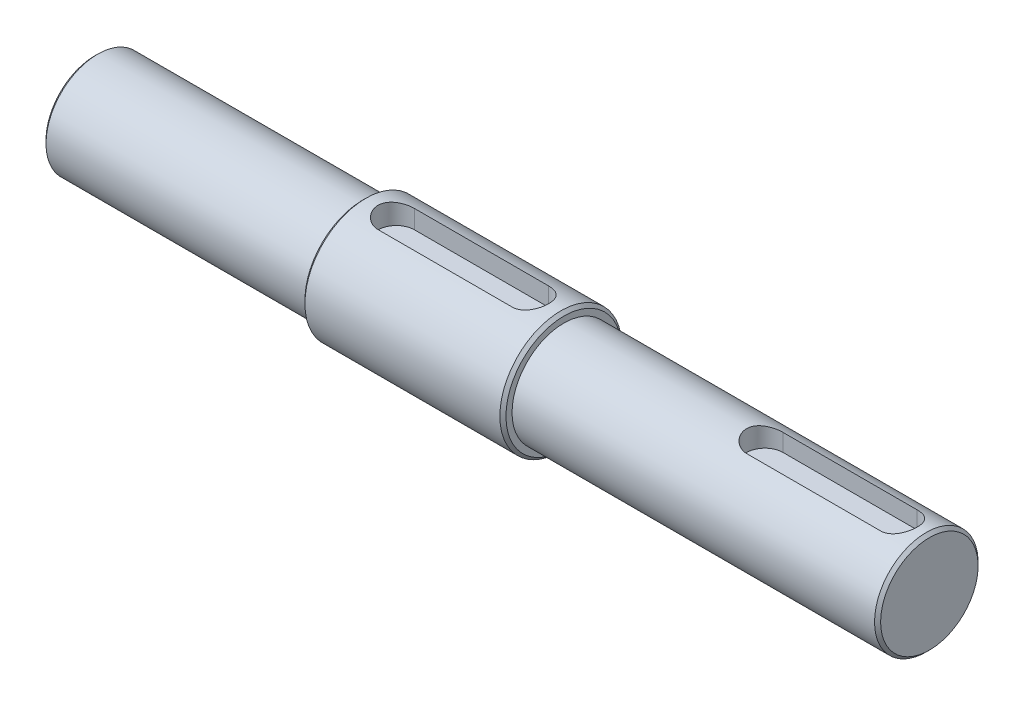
ISO-10303-21;
HEADER;
FILE_DESCRIPTION(('STEP AP214'),'2;1');
FILE_NAME('part.step','',(''),(''),'','','');
FILE_SCHEMA(('AUTOMOTIVE_DESIGN { 1 0 10303 214 1 1 1 1 }'));
ENDSEC;
DATA;
#1=APPLICATION_CONTEXT('core data for automotive mechanical design processes');
#2=APPLICATION_PROTOCOL_DEFINITION('international standard','automotive_design',2000,#1);
#3=PRODUCT_CONTEXT('',#1,'mechanical');
#4=PRODUCT('Part','Part','',(#3));
#5=PRODUCT_RELATED_PRODUCT_CATEGORY('part','',(#4));
#6=PRODUCT_DEFINITION_FORMATION('','',#4);
#7=PRODUCT_DEFINITION_CONTEXT('part definition',#1,'design');
#8=PRODUCT_DEFINITION('design','',#6,#7);
#9=PRODUCT_DEFINITION_SHAPE('','',#8);
#10=(LENGTH_UNIT() NAMED_UNIT(*) SI_UNIT(.MILLI.,.METRE.));
#11=(NAMED_UNIT(*) PLANE_ANGLE_UNIT() SI_UNIT($,.RADIAN.));
#12=(NAMED_UNIT(*) SI_UNIT($,.STERADIAN.) SOLID_ANGLE_UNIT());
#13=UNCERTAINTY_MEASURE_WITH_UNIT(LENGTH_MEASURE(1.E-05),#10,'distance_accuracy_value','');
#14=(GEOMETRIC_REPRESENTATION_CONTEXT(3) GLOBAL_UNCERTAINTY_ASSIGNED_CONTEXT((#13)) GLOBAL_UNIT_ASSIGNED_CONTEXT((#10,
#11,#12)) REPRESENTATION_CONTEXT('',''));
#15=CARTESIAN_POINT('',(0.,0.,0.));
#16=DIRECTION('',(0.,0.,1.));
#17=DIRECTION('',(1.,0.,0.));
#18=AXIS2_PLACEMENT_3D('',#15,#16,#17);
#19=CARTESIAN_POINT('',(0.,0.,0.));
#20=DIRECTION('',(-1.,0.,0.));
#21=DIRECTION('',(0.,0.,1.));
#22=AXIS2_PLACEMENT_3D('',#19,#20,#21);
#23=CYLINDRICAL_SURFACE('',#22,10.);
#24=CARTESIAN_POINT('',(44.5,0.,0.));
#25=DIRECTION('',(1.,0.,0.));
#26=DIRECTION('',(0.,0.,-1.));
#27=AXIS2_PLACEMENT_3D('',#24,#25,#26);
#28=CIRCLE('',#27,10.);
#29=CARTESIAN_POINT('',(44.5,0.,-10.));
#30=VERTEX_POINT('',#29);
#31=EDGE_CURVE('E57',#30,#30,#28,.T.);
#32=ORIENTED_EDGE('',*,*,#31,.T.);
#33=EDGE_LOOP('',(#32));
#34=FACE_BOUND('',#33,.T.);
#35=CARTESIAN_POINT('',(76.5,0.,0.));
#36=DIRECTION('',(-1.,0.,0.));
#37=DIRECTION('',(0.,0.,1.));
#38=AXIS2_PLACEMENT_3D('',#35,#36,#37);
#39=CIRCLE('',#38,10.);
#40=CARTESIAN_POINT('',(76.5,0.,10.));
#41=VERTEX_POINT('',#40);
#42=EDGE_CURVE('E286',#41,#41,#39,.T.);
#43=ORIENTED_EDGE('',*,*,#42,.T.);
#44=EDGE_LOOP('',(#43));
#45=FACE_BOUND('',#44,.T.);
#46=CARTESIAN_POINT('',(71.5,9.53939201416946,3.));
#47=CARTESIAN_POINT('',(71.5823355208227,9.53938054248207,3.00001027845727));
#48=CARTESIAN_POINT('',(71.6646644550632,9.54045772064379,2.99661062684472));
#49=CARTESIAN_POINT('',(71.8286939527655,9.54470412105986,2.98307142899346));
#50=CARTESIAN_POINT('',(71.9103946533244,9.54787287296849,2.97293339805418));
#51=CARTESIAN_POINT('',(72.0723849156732,9.55620668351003,2.94603140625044));
#52=CARTESIAN_POINT('',(72.152677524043,9.56136667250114,2.92928426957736));
#53=CARTESIAN_POINT('',(72.3114758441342,9.57351626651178,2.88932853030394));
#54=CARTESIAN_POINT('',(72.3899815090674,9.58050591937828,2.8661197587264));
#55=CARTESIAN_POINT('',(72.6219493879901,9.60391637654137,2.78708584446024));
#56=CARTESIAN_POINT('',(72.772068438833,9.62279007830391,2.72181852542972));
#57=CARTESIAN_POINT('',(73.059226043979,9.66493213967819,2.56815043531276));
#58=CARTESIAN_POINT('',(73.1962584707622,9.68820254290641,2.4797388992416));
#59=CARTESIAN_POINT('',(73.4577229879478,9.73733650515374,2.27929879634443));
#60=CARTESIAN_POINT('',(73.5816848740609,9.76325505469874,2.16666914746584));
#61=CARTESIAN_POINT('',(73.8092736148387,9.81429628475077,1.92227736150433));
#62=CARTESIAN_POINT('',(73.912897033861,9.8394188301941,1.79051199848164));
#63=CARTESIAN_POINT('',(74.0989268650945,9.88666477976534,1.50821997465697));
#64=CARTESIAN_POINT('',(74.1808501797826,9.90871541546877,1.35736167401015));
#65=CARTESIAN_POINT('',(74.3179770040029,9.94668940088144,1.04324233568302));
#66=CARTESIAN_POINT('',(74.373187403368,9.96261433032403,0.879984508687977));
#67=CARTESIAN_POINT('',(74.453759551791,9.98615279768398,0.550649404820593));
#68=CARTESIAN_POINT('',(74.4799297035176,9.99399098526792,0.384786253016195));
#69=CARTESIAN_POINT('',(74.504234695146,10.0012640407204,0.0508471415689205));
#70=CARTESIAN_POINT('',(74.5023748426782,10.0007004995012,-0.117228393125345));
#71=CARTESIAN_POINT('',(74.4712141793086,9.99139205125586,-0.445143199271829));
#72=CARTESIAN_POINT('',(74.4427893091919,9.98290831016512,-0.605074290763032));
#73=CARTESIAN_POINT('',(74.3607367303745,9.95903027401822,-0.917780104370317));
#74=CARTESIAN_POINT('',(74.3071077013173,9.94363561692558,-1.07055445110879));
#75=CARTESIAN_POINT('',(74.1755755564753,9.90730429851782,-1.36669563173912));
#76=CARTESIAN_POINT('',(74.0973967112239,9.88630511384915,-1.50993201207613));
#77=CARTESIAN_POINT('',(73.9192028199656,9.84099249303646,-1.78153105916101));
#78=CARTESIAN_POINT('',(73.8191828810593,9.81667831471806,-1.90989038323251));
#79=CARTESIAN_POINT('',(73.5956160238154,9.7662334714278,-2.15330901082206));
#80=CARTESIAN_POINT('',(73.4713122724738,9.74006890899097,-2.26766702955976));
#81=CARTESIAN_POINT('',(73.2050051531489,9.68968430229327,-2.47413538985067));
#82=CARTESIAN_POINT('',(73.0629966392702,9.66546482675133,-2.5662392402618));
#83=CARTESIAN_POINT('',(72.7634381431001,9.62154457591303,-2.72632814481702));
#84=CARTESIAN_POINT('',(72.6057456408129,9.60189192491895,-2.79406012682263));
#85=CARTESIAN_POINT('',(72.2805509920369,9.56991327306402,-2.90171772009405));
#86=CARTESIAN_POINT('',(72.1130642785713,9.55757606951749,-2.94168586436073));
#87=CARTESIAN_POINT('',(71.8700102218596,9.54628064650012,-2.97802407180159));
#88=CARTESIAN_POINT('',(71.7962185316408,9.54370312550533,-2.98626405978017));
#89=CARTESIAN_POINT('',(71.648297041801,9.54025857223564,-2.99724711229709));
#90=CARTESIAN_POINT('',(71.5741679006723,9.53938902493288,-2.99999825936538));
#91=CARTESIAN_POINT('',(71.5,9.53939201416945,-3.));
#92=B_SPLINE_CURVE_WITH_KNOTS('',3,(#46,#47,#48,#49,#50,#51,#52,#53,#54,#55,#56,#57,#58,#59,#60,
#61,#62,#63,#64,#65,#66,#67,#68,#69,#70,#71,#72,#73,#74,#75,#76,#77,#78,#79,#80,#81,#82,#83,#84,
#85,#86,#87,#88,#89,#90,#91),.UNSPECIFIED.,.F.,.F.,(4,2,2,2,2,2,2,2,2,2,2,2,2,2,2,2,2,2,2,2,2,2,
4),(0.,0.246918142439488,0.493780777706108,0.740019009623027,0.986263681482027,1.47813347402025,
1.97023245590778,2.47635119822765,2.98255536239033,3.4992281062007,4.01576751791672,
4.51753600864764,5.01920948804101,5.50490358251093,5.99062312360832,6.48200583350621,
6.9734987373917,7.48389234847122,7.99443465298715,8.51013494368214,9.02504345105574,
9.24774267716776,9.47011372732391),.UNSPECIFIED.);
#93=CARTESIAN_POINT('',(71.5,9.53939201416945,3.));
#94=VERTEX_POINT('',#93);
#95=CARTESIAN_POINT('',(71.5,9.53939201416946,-3.));
#96=VERTEX_POINT('',#95);
#97=EDGE_CURVE('E121',#94,#96,#92,.T.);
#98=ORIENTED_EDGE('',*,*,#97,.F.);
#99=DIRECTION('',(-1.,0.,0.));
#100=VECTOR('',#99,1.);
#101=CARTESIAN_POINT('',(0.,9.53939201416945,3.00000000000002));
#102=LINE('',#101,#100);
#103=CARTESIAN_POINT('',(49.5,9.53939201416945,3.00000000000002));
#104=VERTEX_POINT('',#103);
#105=EDGE_CURVE('E231',#104,#94,#102,.F.);
#106=ORIENTED_EDGE('',*,*,#105,.F.);
#107=CARTESIAN_POINT('',(49.5,9.53939201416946,-3.));
#108=CARTESIAN_POINT('',(49.4176644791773,9.53938054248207,-3.00001027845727));
#109=CARTESIAN_POINT('',(49.3353355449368,9.54045772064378,-2.99661062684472));
#110=CARTESIAN_POINT('',(49.1713060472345,9.54470412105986,-2.98307142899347));
#111=CARTESIAN_POINT('',(49.0896053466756,9.54787287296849,-2.97293339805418));
#112=CARTESIAN_POINT('',(48.9276150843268,9.55620668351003,-2.94603140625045));
#113=CARTESIAN_POINT('',(48.847322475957,9.56136667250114,-2.92928426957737));
#114=CARTESIAN_POINT('',(48.6885241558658,9.57351626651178,-2.88932853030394));
#115=CARTESIAN_POINT('',(48.6100184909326,9.58050591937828,-2.8661197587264));
#116=CARTESIAN_POINT('',(48.3780506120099,9.60391637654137,-2.78708584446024));
#117=CARTESIAN_POINT('',(48.227931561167,9.62279007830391,-2.72181852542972));
#118=CARTESIAN_POINT('',(47.940773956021,9.66493213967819,-2.56815043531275));
#119=CARTESIAN_POINT('',(47.8037415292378,9.68820254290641,-2.47973889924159));
#120=CARTESIAN_POINT('',(47.5422770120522,9.73733650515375,-2.27929879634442));
#121=CARTESIAN_POINT('',(47.4183151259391,9.76325505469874,-2.16666914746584));
#122=CARTESIAN_POINT('',(47.1907263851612,9.81429628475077,-1.92227736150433));
#123=CARTESIAN_POINT('',(47.087102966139,9.8394188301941,-1.79051199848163));
#124=CARTESIAN_POINT('',(46.9010731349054,9.88666477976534,-1.50821997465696));
#125=CARTESIAN_POINT('',(46.8191498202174,9.90871541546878,-1.35736167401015));
#126=CARTESIAN_POINT('',(46.6820229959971,9.94668940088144,-1.04324233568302));
#127=CARTESIAN_POINT('',(46.626812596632,9.96261433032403,-0.879984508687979));
#128=CARTESIAN_POINT('',(46.546240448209,9.98615279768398,-0.550649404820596));
#129=CARTESIAN_POINT('',(46.5200702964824,9.99399098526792,-0.384786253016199));
#130=CARTESIAN_POINT('',(46.495765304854,10.0012640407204,-0.0508471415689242));
#131=CARTESIAN_POINT('',(46.4976251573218,10.0007004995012,0.117228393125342));
#132=CARTESIAN_POINT('',(46.5287858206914,9.99139205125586,0.445143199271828));
#133=CARTESIAN_POINT('',(46.5572106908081,9.98290831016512,0.605074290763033));
#134=CARTESIAN_POINT('',(46.6392632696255,9.95903027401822,0.917780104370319));
#135=CARTESIAN_POINT('',(46.6928922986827,9.94363561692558,1.07055445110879));
#136=CARTESIAN_POINT('',(46.8244244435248,9.90730429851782,1.36669563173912));
#137=CARTESIAN_POINT('',(46.9026032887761,9.88630511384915,1.50993201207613));
#138=CARTESIAN_POINT('',(47.0807971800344,9.84099249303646,1.78153105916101));
#139=CARTESIAN_POINT('',(47.1808171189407,9.81667831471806,1.90989038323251));
#140=CARTESIAN_POINT('',(47.4043839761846,9.7662334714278,2.15330901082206));
#141=CARTESIAN_POINT('',(47.5286877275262,9.74006890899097,2.26766702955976));
#142=CARTESIAN_POINT('',(47.7949948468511,9.68968430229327,2.47413538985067));
#143=CARTESIAN_POINT('',(47.9370033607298,9.66546482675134,2.56623924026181));
#144=CARTESIAN_POINT('',(48.2365618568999,9.62154457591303,2.72632814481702));
#145=CARTESIAN_POINT('',(48.3942543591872,9.60189192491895,2.79406012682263));
#146=CARTESIAN_POINT('',(48.7194490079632,9.56991327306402,2.90171772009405));
#147=CARTESIAN_POINT('',(48.8869357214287,9.55757606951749,2.94168586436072));
#148=CARTESIAN_POINT('',(49.1299897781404,9.54628064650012,2.97802407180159));
#149=CARTESIAN_POINT('',(49.2037814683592,9.54370312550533,2.98626405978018));
#150=CARTESIAN_POINT('',(49.3517029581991,9.54025857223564,2.99724711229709));
#151=CARTESIAN_POINT('',(49.4258320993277,9.53938902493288,2.99999825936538));
#152=CARTESIAN_POINT('',(49.5,9.53939201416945,3.));
#153=B_SPLINE_CURVE_WITH_KNOTS('',3,(#107,#108,#109,#110,#111,#112,#113,#114,#115,#116,#117,
#118,#119,#120,#121,#122,#123,#124,#125,#126,#127,#128,#129,#130,#131,#132,#133,#134,#135,#136,
#137,#138,#139,#140,#141,#142,#143,#144,#145,#146,#147,#148,#149,#150,#151,#152),.UNSPECIFIED.,
.F.,.F.,(4,2,2,2,2,2,2,2,2,2,2,2,2,2,2,2,2,2,2,2,2,2,4),(0.,0.246918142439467,0.493780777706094,
0.74001900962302,0.986263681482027,1.47813347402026,1.97023245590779,2.47635119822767,
2.98255536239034,3.49922810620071,4.01576751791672,4.51753600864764,5.01920948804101,
5.50490358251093,5.99062312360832,6.48200583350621,6.9734987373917,7.48389234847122,
7.99443465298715,8.51013494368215,9.02504345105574,9.24774267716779,9.47011372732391),.UNSPECIFIED.);
#154=CARTESIAN_POINT('',(49.5,9.53939201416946,-3.));
#155=VERTEX_POINT('',#154);
#156=EDGE_CURVE('E234',#155,#104,#153,.T.);
#157=ORIENTED_EDGE('',*,*,#156,.F.);
#158=DIRECTION('',(-1.,0.,0.));
#159=VECTOR('',#158,1.);
#160=CARTESIAN_POINT('',(0.,9.53939201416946,-2.99999999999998));
#161=LINE('',#160,#159);
#162=EDGE_CURVE('E243',#96,#155,#161,.T.);
#163=ORIENTED_EDGE('',*,*,#162,.F.);
#164=EDGE_LOOP('',(#98,#106,#157,#163));
#165=FACE_BOUND('',#164,.T.);
#166=ADVANCED_FACE('F47',(#34,#45,#165),#23,.T.);
#167=CARTESIAN_POINT('',(0.,0.,0.));
#168=DIRECTION('',(-1.,0.,0.));
#169=DIRECTION('',(0.,0.,1.));
#170=AXIS2_PLACEMENT_3D('',#167,#168,#169);
#171=CYLINDRICAL_SURFACE('',#170,8.5);
#172=CARTESIAN_POINT('',(136.5,0.,0.));
#173=DIRECTION('',(-1.,0.,0.));
#174=DIRECTION('',(0.,0.,1.));
#175=AXIS2_PLACEMENT_3D('',#172,#173,#174);
#176=CIRCLE('',#175,8.5);
#177=CARTESIAN_POINT('',(136.5,0.,8.5));
#178=VERTEX_POINT('',#177);
#179=EDGE_CURVE('E266',#178,#178,#176,.T.);
#180=ORIENTED_EDGE('',*,*,#179,.T.);
#181=EDGE_LOOP('',(#180));
#182=FACE_BOUND('',#181,.T.);
#183=CARTESIAN_POINT('',(77.,0.,0.));
#184=DIRECTION('',(-1.,0.,0.));
#185=DIRECTION('',(0.,0.,1.));
#186=AXIS2_PLACEMENT_3D('',#183,#184,#185);
#187=CIRCLE('',#186,8.5);
#188=CARTESIAN_POINT('',(77.,0.,8.5));
#189=VERTEX_POINT('',#188);
#190=EDGE_CURVE('E181',#189,#189,#187,.T.);
#191=ORIENTED_EDGE('',*,*,#190,.F.);
#192=EDGE_LOOP('',(#191));
#193=FACE_BOUND('',#192,.T.);
#194=CARTESIAN_POINT('',(132.,7.95298686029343,3.));
#195=CARTESIAN_POINT('',(132.081536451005,7.95297282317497,3.0000111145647));
#196=CARTESIAN_POINT('',(132.16306513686,7.95424043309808,2.99667616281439));
#197=CARTESIAN_POINT('',(132.32548339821,7.95923435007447,2.98340078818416));
#198=CARTESIAN_POINT('',(132.406373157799,7.96295992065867,2.97346234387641));
#199=CARTESIAN_POINT('',(132.56668088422,7.97274948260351,2.94710907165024));
#200=CARTESIAN_POINT('',(132.646102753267,7.97880590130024,2.93071521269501));
#201=CARTESIAN_POINT('',(132.803163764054,7.99305602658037,2.89162336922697));
#202=CARTESIAN_POINT('',(132.88080282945,8.00124982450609,2.86892511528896));
#203=CARTESIAN_POINT('',(133.110142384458,8.02866628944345,2.79169040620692));
#204=CARTESIAN_POINT('',(133.258524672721,8.05074111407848,2.72797079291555));
#205=CARTESIAN_POINT('',(133.542527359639,8.09998309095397,2.57807364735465));
#206=CARTESIAN_POINT('',(133.678138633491,8.12715384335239,2.49188022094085));
#207=CARTESIAN_POINT('',(133.938713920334,8.18485393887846,2.29543806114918));
#208=CARTESIAN_POINT('',(134.063041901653,8.21547377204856,2.18437050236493));
#209=CARTESIAN_POINT('',(134.291744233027,8.2758622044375,1.94307879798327));
#210=CARTESIAN_POINT('',(134.396114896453,8.30563064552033,1.81285112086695));
#211=CARTESIAN_POINT('',(134.584937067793,8.36202878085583,1.53216678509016));
#212=CARTESIAN_POINT('',(134.668705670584,8.38853913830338,1.38122456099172));
#213=CARTESIAN_POINT('',(134.809399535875,8.43435112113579,1.06629732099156));
#214=CARTESIAN_POINT('',(134.866333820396,8.45365516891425,0.90231671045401));
#215=CARTESIAN_POINT('',(134.949541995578,8.48223599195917,0.572686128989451));
#216=CARTESIAN_POINT('',(134.976915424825,8.49187134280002,0.407345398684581));
#217=CARTESIAN_POINT('',(135.003733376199,8.50130846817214,0.0741521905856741));
#218=CARTESIAN_POINT('',(135.003185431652,8.50111289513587,-0.0936995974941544));
#219=CARTESIAN_POINT('',(134.974846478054,8.49114603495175,-0.419317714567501));
#220=CARTESIAN_POINT('',(134.948252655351,8.4817955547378,-0.577203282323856));
#221=CARTESIAN_POINT('',(134.870572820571,8.4551088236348,-0.88610464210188));
#222=CARTESIAN_POINT('',(134.819485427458,8.43777212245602,-1.03712004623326));
#223=CARTESIAN_POINT('',(134.693635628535,8.39655303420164,-1.33047393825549));
#224=CARTESIAN_POINT('',(134.618554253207,8.3725830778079,-1.47266277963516));
#225=CARTESIAN_POINT('',(134.447121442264,8.32056133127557,-1.742757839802));
#226=CARTESIAN_POINT('',(134.350763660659,8.29250832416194,-1.87065978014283));
#227=CARTESIAN_POINT('',(134.133598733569,8.23351601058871,-2.11563702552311));
#228=CARTESIAN_POINT('',(134.011776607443,8.20250248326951,-2.23179650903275));
#229=CARTESIAN_POINT('',(133.750160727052,8.1422878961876,-2.44236946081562));
#230=CARTESIAN_POINT('',(133.610360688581,8.11308747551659,-2.53677529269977));
#231=CARTESIAN_POINT('',(133.313330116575,8.05935715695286,-2.70269404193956));
#232=CARTESIAN_POINT('',(133.155828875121,8.03492183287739,-2.77375950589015));
#233=CARTESIAN_POINT('',(132.911749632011,8.0046686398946,-2.85940108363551));
#234=CARTESIAN_POINT('',(132.829101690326,7.9956519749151,-2.88445274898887));
#235=CARTESIAN_POINT('',(132.661749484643,7.98003696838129,-2.92737680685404));
#236=CARTESIAN_POINT('',(132.577046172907,7.97343752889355,-2.94525245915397));
#237=CARTESIAN_POINT('',(132.410501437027,7.96316283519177,-2.97292025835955));
#238=CARTESIAN_POINT('',(132.328726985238,7.95935855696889,-2.9830699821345));
#239=CARTESIAN_POINT('',(132.164637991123,7.95426482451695,-2.99661152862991));
#240=CARTESIAN_POINT('',(132.082324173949,7.95297249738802,-3.00001107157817));
#241=CARTESIAN_POINT('',(132.,7.95298686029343,-3.));
#242=B_SPLINE_CURVE_WITH_KNOTS('',3,(#194,#195,#196,#197,#198,#199,#200,#201,#202,#203,#204,
#205,#206,#207,#208,#209,#210,#211,#212,#213,#214,#215,#216,#217,#218,#219,#220,#221,#222,#223,
#224,#225,#226,#227,#228,#229,#230,#231,#232,#233,#234,#235,#236,#237,#238,#239,#240,#241),
.UNSPECIFIED.,.F.,.F.,(4,2,2,2,2,2,2,2,2,2,2,2,2,2,2,2,2,2,2,2,2,2,2,4),(0.,0.244518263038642,
0.488963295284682,0.732620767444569,0.976288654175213,1.46284365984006,1.9497437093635,
2.45596459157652,2.96227889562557,3.48361603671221,4.00477777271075,4.50580525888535,
5.00669756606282,5.4855977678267,5.9645249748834,6.45010405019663,6.93582815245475,
7.44695039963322,7.95825179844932,8.47884978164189,8.73905037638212,8.99913263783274,
9.24628958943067,9.49316370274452),.UNSPECIFIED.);
#243=CARTESIAN_POINT('',(132.,7.95298686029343,3.));
#244=VERTEX_POINT('',#243);
#245=CARTESIAN_POINT('',(132.,7.95298686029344,-3.));
#246=VERTEX_POINT('',#245);
#247=EDGE_CURVE('E224',#244,#246,#242,.T.);
#248=ORIENTED_EDGE('',*,*,#247,.F.);
#249=DIRECTION('',(-1.,0.,0.));
#250=VECTOR('',#249,1.);
#251=CARTESIAN_POINT('',(0.,7.95298686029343,3.00000000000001));
#252=LINE('',#251,#250);
#253=CARTESIAN_POINT('',(110.,7.95298686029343,3.00000000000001));
#254=VERTEX_POINT('',#253);
#255=EDGE_CURVE('E189',#254,#244,#252,.F.);
#256=ORIENTED_EDGE('',*,*,#255,.F.);
#257=CARTESIAN_POINT('',(110.,7.95298686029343,-3.));
#258=CARTESIAN_POINT('',(109.918463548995,7.95297282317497,-3.00001111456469));
#259=CARTESIAN_POINT('',(109.83693486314,7.95424043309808,-2.99667616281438));
#260=CARTESIAN_POINT('',(109.67451660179,7.95923435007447,-2.98340078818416));
#261=CARTESIAN_POINT('',(109.593626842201,7.96295992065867,-2.97346234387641));
#262=CARTESIAN_POINT('',(109.43331911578,7.97274948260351,-2.94710907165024));
#263=CARTESIAN_POINT('',(109.353897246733,7.97880590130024,-2.93071521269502));
#264=CARTESIAN_POINT('',(109.196836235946,7.99305602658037,-2.89162336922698));
#265=CARTESIAN_POINT('',(109.119197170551,8.00124982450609,-2.86892511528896));
#266=CARTESIAN_POINT('',(108.889857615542,8.02866628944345,-2.79169040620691));
#267=CARTESIAN_POINT('',(108.741475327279,8.05074111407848,-2.72797079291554));
#268=CARTESIAN_POINT('',(108.457472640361,8.09998309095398,-2.57807364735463));
#269=CARTESIAN_POINT('',(108.321861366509,8.12715384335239,-2.49188022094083));
#270=CARTESIAN_POINT('',(108.061286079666,8.18485393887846,-2.29543806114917));
#271=CARTESIAN_POINT('',(107.936958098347,8.21547377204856,-2.18437050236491));
#272=CARTESIAN_POINT('',(107.708255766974,8.2758622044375,-1.94307879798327));
#273=CARTESIAN_POINT('',(107.603885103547,8.30563064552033,-1.81285112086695));
#274=CARTESIAN_POINT('',(107.415062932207,8.36202878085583,-1.53216678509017));
#275=CARTESIAN_POINT('',(107.331294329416,8.38853913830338,-1.38122456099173));
#276=CARTESIAN_POINT('',(107.190600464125,8.43435112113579,-1.06629732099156));
#277=CARTESIAN_POINT('',(107.133666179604,8.45365516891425,-0.902316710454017));
#278=CARTESIAN_POINT('',(107.050458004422,8.48223599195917,-0.572686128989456));
#279=CARTESIAN_POINT('',(107.023084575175,8.49187134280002,-0.407345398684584));
#280=CARTESIAN_POINT('',(106.996266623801,8.50130846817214,-0.0741521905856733));
#281=CARTESIAN_POINT('',(106.996814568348,8.50111289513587,0.0936995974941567));
#282=CARTESIAN_POINT('',(107.025153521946,8.49114603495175,0.419317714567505));
#283=CARTESIAN_POINT('',(107.051747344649,8.4817955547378,0.577203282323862));
#284=CARTESIAN_POINT('',(107.129427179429,8.4551088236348,0.886104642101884));
#285=CARTESIAN_POINT('',(107.180514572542,8.43777212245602,1.03712004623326));
#286=CARTESIAN_POINT('',(107.306364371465,8.39655303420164,1.33047393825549));
#287=CARTESIAN_POINT('',(107.381445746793,8.3725830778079,1.47266277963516));
#288=CARTESIAN_POINT('',(107.552878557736,8.32056133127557,1.742757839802));
#289=CARTESIAN_POINT('',(107.649236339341,8.29250832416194,1.87065978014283));
#290=CARTESIAN_POINT('',(107.866401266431,8.23351601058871,2.11563702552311));
#291=CARTESIAN_POINT('',(107.988223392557,8.20250248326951,2.23179650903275));
#292=CARTESIAN_POINT('',(108.249839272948,8.1422878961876,2.44236946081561));
#293=CARTESIAN_POINT('',(108.389639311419,8.11308747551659,2.53677529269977));
#294=CARTESIAN_POINT('',(108.686669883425,8.05935715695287,2.70269404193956));
#295=CARTESIAN_POINT('',(108.844171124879,8.03492183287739,2.77375950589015));
#296=CARTESIAN_POINT('',(109.088250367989,8.0046686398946,2.85940108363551));
#297=CARTESIAN_POINT('',(109.170898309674,7.9956519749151,2.88445274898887));
#298=CARTESIAN_POINT('',(109.338250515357,7.98003696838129,2.92737680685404));
#299=CARTESIAN_POINT('',(109.422953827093,7.97343752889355,2.94525245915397));
#300=CARTESIAN_POINT('',(109.589498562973,7.96316283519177,2.97292025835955));
#301=CARTESIAN_POINT('',(109.671273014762,7.95935855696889,2.9830699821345));
#302=CARTESIAN_POINT('',(109.835362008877,7.95426482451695,2.99661152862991));
#303=CARTESIAN_POINT('',(109.917675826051,7.95297249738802,3.00001107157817));
#304=CARTESIAN_POINT('',(110.,7.95298686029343,3.));
#305=B_SPLINE_CURVE_WITH_KNOTS('',3,(#257,#258,#259,#260,#261,#262,#263,#264,#265,#266,#267,
#268,#269,#270,#271,#272,#273,#274,#275,#276,#277,#278,#279,#280,#281,#282,#283,#284,#285,#286,
#287,#288,#289,#290,#291,#292,#293,#294,#295,#296,#297,#298,#299,#300,#301,#302,#303,#304),
.UNSPECIFIED.,.F.,.F.,(4,2,2,2,2,2,2,2,2,2,2,2,2,2,2,2,2,2,2,2,2,2,2,4),(0.,0.244518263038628,
0.488963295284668,0.732620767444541,0.976288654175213,1.4628436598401,1.94974370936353,
2.45596459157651,2.96227889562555,3.4836160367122,4.00477777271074,4.50580525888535,
5.00669756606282,5.4855977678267,5.9645249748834,6.45010405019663,6.93582815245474,
7.44695039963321,7.95825179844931,8.47884978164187,8.73905037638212,8.99913263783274,
9.24628958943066,9.49316370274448),.UNSPECIFIED.);
#306=CARTESIAN_POINT('',(110.,7.95298686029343,-3.));
#307=VERTEX_POINT('',#306);
#308=EDGE_CURVE('E192',#307,#254,#305,.T.);
#309=ORIENTED_EDGE('',*,*,#308,.F.);
#310=DIRECTION('',(-1.,0.,0.));
#311=VECTOR('',#310,1.);
#312=CARTESIAN_POINT('',(0.,7.95298686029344,-2.99999999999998));
#313=LINE('',#312,#311);
#314=EDGE_CURVE('E201',#246,#307,#313,.T.);
#315=ORIENTED_EDGE('',*,*,#314,.F.);
#316=EDGE_LOOP('',(#248,#256,#309,#315));
#317=FACE_BOUND('',#316,.T.);
#318=ADVANCED_FACE('F203',(#182,#193,#317),#171,.T.);
#319=CARTESIAN_POINT('',(0.,0.,0.));
#320=DIRECTION('',(1.,0.,0.));
#321=DIRECTION('',(0.,0.,-1.));
#322=AXIS2_PLACEMENT_3D('',#319,#320,#321);
#323=PLANE('',#322);
#324=CARTESIAN_POINT('',(0.,0.,0.));
#325=DIRECTION('',(1.,0.,0.));
#326=DIRECTION('',(0.,0.,-1.));
#327=AXIS2_PLACEMENT_3D('',#324,#325,#326);
#328=CIRCLE('',#327,8.00000000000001);
#329=CARTESIAN_POINT('',(0.,0.,-8.00000000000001));
#330=VERTEX_POINT('',#329);
#331=EDGE_CURVE('E274',#330,#330,#328,.F.);
#332=ORIENTED_EDGE('',*,*,#331,.T.);
#333=EDGE_LOOP('',(#332));
#334=FACE_BOUND('',#333,.T.);
#335=ADVANCED_FACE('F309',(#334),#323,.F.);
#336=CARTESIAN_POINT('',(0.,0.,0.));
#337=DIRECTION('',(-1.,0.,0.));
#338=DIRECTION('',(0.,0.,1.));
#339=AXIS2_PLACEMENT_3D('',#336,#337,#338);
#340=CYLINDRICAL_SURFACE('',#339,8.5);
#341=CARTESIAN_POINT('',(0.500000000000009,0.,0.));
#342=DIRECTION('',(1.,0.,0.));
#343=DIRECTION('',(0.,0.,-1.));
#344=AXIS2_PLACEMENT_3D('',#341,#342,#343);
#345=CIRCLE('',#344,8.5);
#346=CARTESIAN_POINT('',(0.500000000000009,0.,-8.5));
#347=VERTEX_POINT('',#346);
#348=EDGE_CURVE('E278',#347,#347,#345,.T.);
#349=ORIENTED_EDGE('',*,*,#348,.T.);
#350=EDGE_LOOP('',(#349));
#351=FACE_BOUND('',#350,.T.);
#352=CARTESIAN_POINT('',(44.,0.,0.));
#353=DIRECTION('',(-1.,0.,0.));
#354=DIRECTION('',(0.,0.,1.));
#355=AXIS2_PLACEMENT_3D('',#352,#353,#354);
#356=CIRCLE('',#355,8.5);
#357=CARTESIAN_POINT('',(44.,0.,8.5));
#358=VERTEX_POINT('',#357);
#359=EDGE_CURVE('E185',#358,#358,#356,.T.);
#360=ORIENTED_EDGE('',*,*,#359,.T.);
#361=EDGE_LOOP('',(#360));
#362=FACE_BOUND('',#361,.T.);
#363=ADVANCED_FACE('F305',(#351,#362),#340,.T.);
#364=CARTESIAN_POINT('',(44.,8.5,0.));
#365=DIRECTION('',(1.,0.,0.));
#366=DIRECTION('',(0.,0.,-1.));
#367=AXIS2_PLACEMENT_3D('',#364,#365,#366);
#368=PLANE('',#367);
#369=CARTESIAN_POINT('',(44.,0.,0.));
#370=DIRECTION('',(1.,0.,0.));
#371=DIRECTION('',(0.,0.,-1.));
#372=AXIS2_PLACEMENT_3D('',#369,#370,#371);
#373=CIRCLE('',#372,9.49999999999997);
#374=CARTESIAN_POINT('',(44.,0.,-9.49999999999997));
#375=VERTEX_POINT('',#374);
#376=EDGE_CURVE('E282',#375,#375,#373,.F.);
#377=ORIENTED_EDGE('',*,*,#376,.T.);
#378=EDGE_LOOP('',(#377));
#379=FACE_BOUND('',#378,.T.);
#380=ORIENTED_EDGE('',*,*,#359,.F.);
#381=EDGE_LOOP('',(#380));
#382=FACE_BOUND('',#381,.T.);
#383=ADVANCED_FACE('F301',(#379,#382),#368,.F.);
#384=CARTESIAN_POINT('',(77.,10.,0.));
#385=DIRECTION('',(-1.,0.,0.));
#386=DIRECTION('',(0.,0.,1.));
#387=AXIS2_PLACEMENT_3D('',#384,#385,#386);
#388=PLANE('',#387);
#389=CARTESIAN_POINT('',(77.,0.,0.));
#390=DIRECTION('',(-1.,0.,0.));
#391=DIRECTION('',(0.,0.,1.));
#392=AXIS2_PLACEMENT_3D('',#389,#390,#391);
#393=CIRCLE('',#392,9.49999999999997);
#394=CARTESIAN_POINT('',(77.,0.,9.49999999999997));
#395=VERTEX_POINT('',#394);
#396=EDGE_CURVE('E11',#395,#395,#393,.F.);
#397=ORIENTED_EDGE('',*,*,#396,.T.);
#398=EDGE_LOOP('',(#397));
#399=FACE_BOUND('',#398,.T.);
#400=ORIENTED_EDGE('',*,*,#190,.T.);
#401=EDGE_LOOP('',(#400));
#402=FACE_BOUND('',#401,.T.);
#403=ADVANCED_FACE('F304',(#399,#402),#388,.F.);
#404=CARTESIAN_POINT('',(137.,8.5,0.));
#405=DIRECTION('',(-1.,0.,0.));
#406=DIRECTION('',(0.,0.,1.));
#407=AXIS2_PLACEMENT_3D('',#404,#405,#406);
#408=PLANE('',#407);
#409=CARTESIAN_POINT('',(137.,0.,0.));
#410=DIRECTION('',(-1.,0.,0.));
#411=DIRECTION('',(0.,0.,1.));
#412=AXIS2_PLACEMENT_3D('',#409,#410,#411);
#413=CIRCLE('',#412,8.00000000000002);
#414=CARTESIAN_POINT('',(137.,0.,8.00000000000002));
#415=VERTEX_POINT('',#414);
#416=EDGE_CURVE('E270',#415,#415,#413,.F.);
#417=ORIENTED_EDGE('',*,*,#416,.T.);
#418=EDGE_LOOP('',(#417));
#419=FACE_BOUND('',#418,.T.);
#420=ADVANCED_FACE('F222',(#419),#408,.F.);
#421=CARTESIAN_POINT('',(132.,15.1,0.));
#422=DIRECTION('',(0.,-1.,0.));
#423=DIRECTION('',(0.,0.,-1.));
#424=AXIS2_PLACEMENT_3D('',#421,#422,#423);
#425=CYLINDRICAL_SURFACE('',#424,3.);
#426=ORIENTED_EDGE('',*,*,#247,.T.);
#427=DIRECTION('',(0.,-1.,0.));
#428=VECTOR('',#427,1.);
#429=CARTESIAN_POINT('',(132.,15.1,-3.));
#430=LINE('',#429,#428);
#431=CARTESIAN_POINT('',(132.,5.1,-3.));
#432=VERTEX_POINT('',#431);
#433=EDGE_CURVE('E178',#246,#432,#430,.T.);
#434=ORIENTED_EDGE('',*,*,#433,.T.);
#435=CARTESIAN_POINT('',(132.,5.1,0.));
#436=DIRECTION('',(0.,1.,0.));
#437=DIRECTION('',(0.,0.,1.));
#438=AXIS2_PLACEMENT_3D('',#435,#436,#437);
#439=CIRCLE('',#438,3.);
#440=CARTESIAN_POINT('',(132.,5.1,3.));
#441=VERTEX_POINT('',#440);
#442=EDGE_CURVE('E125',#441,#432,#439,.T.);
#443=ORIENTED_EDGE('',*,*,#442,.F.);
#444=DIRECTION('',(0.,-1.,0.));
#445=VECTOR('',#444,1.);
#446=CARTESIAN_POINT('',(132.,15.1,3.));
#447=LINE('',#446,#445);
#448=EDGE_CURVE('E170',#244,#441,#447,.T.);
#449=ORIENTED_EDGE('',*,*,#448,.F.);
#450=EDGE_LOOP('',(#426,#434,#443,#449));
#451=FACE_BOUND('',#450,.T.);
#452=ADVANCED_FACE('F218',(#451),#425,.F.);
#453=CARTESIAN_POINT('',(132.,15.1,-3.));
#454=DIRECTION('',(0.,0.,1.));
#455=DIRECTION('',(1.,0.,0.));
#456=AXIS2_PLACEMENT_3D('',#453,#454,#455);
#457=PLANE('',#456);
#458=ORIENTED_EDGE('',*,*,#314,.T.);
#459=DIRECTION('',(0.,-1.,0.));
#460=VECTOR('',#459,1.);
#461=CARTESIAN_POINT('',(110.,15.1,-3.));
#462=LINE('',#461,#460);
#463=CARTESIAN_POINT('',(110.,5.1,-3.));
#464=VERTEX_POINT('',#463);
#465=EDGE_CURVE('E175',#307,#464,#462,.T.);
#466=ORIENTED_EDGE('',*,*,#465,.T.);
#467=DIRECTION('',(-1.,0.,0.));
#468=VECTOR('',#467,1.);
#469=CARTESIAN_POINT('',(132.,5.1,-3.));
#470=LINE('',#469,#468);
#471=EDGE_CURVE('E158',#432,#464,#470,.T.);
#472=ORIENTED_EDGE('',*,*,#471,.F.);
#473=ORIENTED_EDGE('',*,*,#433,.F.);
#474=EDGE_LOOP('',(#458,#466,#472,#473));
#475=FACE_BOUND('',#474,.T.);
#476=ADVANCED_FACE('F213',(#475),#457,.T.);
#477=CARTESIAN_POINT('',(110.,15.1,0.));
#478=DIRECTION('',(0.,-1.,0.));
#479=DIRECTION('',(0.,0.,-1.));
#480=AXIS2_PLACEMENT_3D('',#477,#478,#479);
#481=CYLINDRICAL_SURFACE('',#480,3.);
#482=ORIENTED_EDGE('',*,*,#308,.T.);
#483=DIRECTION('',(0.,-1.,0.));
#484=VECTOR('',#483,1.);
#485=CARTESIAN_POINT('',(110.,15.1,3.));
#486=LINE('',#485,#484);
#487=CARTESIAN_POINT('',(110.,5.1,3.));
#488=VERTEX_POINT('',#487);
#489=EDGE_CURVE('E72',#254,#488,#486,.T.);
#490=ORIENTED_EDGE('',*,*,#489,.T.);
#491=CARTESIAN_POINT('',(110.,5.1,0.));
#492=DIRECTION('',(0.,1.,0.));
#493=DIRECTION('',(0.,0.,1.));
#494=AXIS2_PLACEMENT_3D('',#491,#492,#493);
#495=CIRCLE('',#494,3.);
#496=EDGE_CURVE('E162',#464,#488,#495,.T.);
#497=ORIENTED_EDGE('',*,*,#496,.F.);
#498=ORIENTED_EDGE('',*,*,#465,.F.);
#499=EDGE_LOOP('',(#482,#490,#497,#498));
#500=FACE_BOUND('',#499,.T.);
#501=ADVANCED_FACE('F207',(#500),#481,.F.);
#502=CARTESIAN_POINT('',(132.,15.1,3.));
#503=DIRECTION('',(0.,0.,-1.));
#504=DIRECTION('',(-1.,0.,0.));
#505=AXIS2_PLACEMENT_3D('',#502,#503,#504);
#506=PLANE('',#505);
#507=ORIENTED_EDGE('',*,*,#255,.T.);
#508=ORIENTED_EDGE('',*,*,#448,.T.);
#509=DIRECTION('',(1.,0.,0.));
#510=VECTOR('',#509,1.);
#511=CARTESIAN_POINT('',(132.,5.1,3.));
#512=LINE('',#511,#510);
#513=EDGE_CURVE('E166',#488,#441,#512,.T.);
#514=ORIENTED_EDGE('',*,*,#513,.F.);
#515=ORIENTED_EDGE('',*,*,#489,.F.);
#516=EDGE_LOOP('',(#507,#508,#514,#515));
#517=FACE_BOUND('',#516,.T.);
#518=ADVANCED_FACE('F212',(#517),#506,.T.);
#519=CARTESIAN_POINT('',(132.,5.1,0.));
#520=DIRECTION('',(0.,1.,0.));
#521=DIRECTION('',(0.,0.,1.));
#522=AXIS2_PLACEMENT_3D('',#519,#520,#521);
#523=PLANE('',#522);
#524=ORIENTED_EDGE('',*,*,#442,.T.);
#525=ORIENTED_EDGE('',*,*,#471,.T.);
#526=ORIENTED_EDGE('',*,*,#496,.T.);
#527=ORIENTED_EDGE('',*,*,#513,.T.);
#528=EDGE_LOOP('',(#524,#525,#526,#527));
#529=FACE_BOUND('',#528,.T.);
#530=ADVANCED_FACE('F259',(#529),#523,.T.);
#531=CARTESIAN_POINT('',(71.5,16.5,0.));
#532=DIRECTION('',(0.,-1.,0.));
#533=DIRECTION('',(0.,0.,-1.));
#534=AXIS2_PLACEMENT_3D('',#531,#532,#533);
#535=CYLINDRICAL_SURFACE('',#534,3.);
#536=ORIENTED_EDGE('',*,*,#97,.T.);
#537=DIRECTION('',(0.,-1.,0.));
#538=VECTOR('',#537,1.);
#539=CARTESIAN_POINT('',(71.5,16.5,-3.));
#540=LINE('',#539,#538);
#541=CARTESIAN_POINT('',(71.5,6.5,-3.));
#542=VERTEX_POINT('',#541);
#543=EDGE_CURVE('E114',#96,#542,#540,.T.);
#544=ORIENTED_EDGE('',*,*,#543,.T.);
#545=CARTESIAN_POINT('',(71.5,6.5,0.));
#546=DIRECTION('',(0.,1.,0.));
#547=DIRECTION('',(0.,0.,1.));
#548=AXIS2_PLACEMENT_3D('',#545,#546,#547);
#549=CIRCLE('',#548,3.);
#550=CARTESIAN_POINT('',(71.5,6.5,3.));
#551=VERTEX_POINT('',#550);
#552=EDGE_CURVE('E119',#551,#542,#549,.T.);
#553=ORIENTED_EDGE('',*,*,#552,.F.);
#554=DIRECTION('',(0.,-1.,0.));
#555=VECTOR('',#554,1.);
#556=CARTESIAN_POINT('',(71.5,16.5,3.));
#557=LINE('',#556,#555);
#558=EDGE_CURVE('E148',#94,#551,#557,.T.);
#559=ORIENTED_EDGE('',*,*,#558,.F.);
#560=EDGE_LOOP('',(#536,#544,#553,#559));
#561=FACE_BOUND('',#560,.T.);
#562=ADVANCED_FACE('F116',(#561),#535,.F.);
#563=CARTESIAN_POINT('',(71.5,16.5,-3.));
#564=DIRECTION('',(0.,0.,1.));
#565=DIRECTION('',(1.,0.,0.));
#566=AXIS2_PLACEMENT_3D('',#563,#564,#565);
#567=PLANE('',#566);
#568=ORIENTED_EDGE('',*,*,#162,.T.);
#569=DIRECTION('',(0.,-1.,0.));
#570=VECTOR('',#569,1.);
#571=CARTESIAN_POINT('',(49.5,16.5,-3.));
#572=LINE('',#571,#570);
#573=CARTESIAN_POINT('',(49.5,6.5,-3.));
#574=VERTEX_POINT('',#573);
#575=EDGE_CURVE('E126',#155,#574,#572,.T.);
#576=ORIENTED_EDGE('',*,*,#575,.T.);
#577=DIRECTION('',(-1.,0.,0.));
#578=VECTOR('',#577,1.);
#579=CARTESIAN_POINT('',(71.5,6.5,-3.));
#580=LINE('',#579,#578);
#581=EDGE_CURVE('E129',#542,#574,#580,.T.);
#582=ORIENTED_EDGE('',*,*,#581,.F.);
#583=ORIENTED_EDGE('',*,*,#543,.F.);
#584=EDGE_LOOP('',(#568,#576,#582,#583));
#585=FACE_BOUND('',#584,.T.);
#586=ADVANCED_FACE('F130',(#585),#567,.T.);
#587=CARTESIAN_POINT('',(49.5,16.5,0.));
#588=DIRECTION('',(0.,-1.,0.));
#589=DIRECTION('',(0.,0.,-1.));
#590=AXIS2_PLACEMENT_3D('',#587,#588,#589);
#591=CYLINDRICAL_SURFACE('',#590,3.);
#592=ORIENTED_EDGE('',*,*,#156,.T.);
#593=DIRECTION('',(0.,-1.,0.));
#594=VECTOR('',#593,1.);
#595=CARTESIAN_POINT('',(49.5,16.5,3.));
#596=LINE('',#595,#594);
#597=CARTESIAN_POINT('',(49.5,6.5,3.));
#598=VERTEX_POINT('',#597);
#599=EDGE_CURVE('E64',#104,#598,#596,.T.);
#600=ORIENTED_EDGE('',*,*,#599,.T.);
#601=CARTESIAN_POINT('',(49.5,6.5,0.));
#602=DIRECTION('',(0.,1.,0.));
#603=DIRECTION('',(0.,0.,1.));
#604=AXIS2_PLACEMENT_3D('',#601,#602,#603);
#605=CIRCLE('',#604,3.);
#606=EDGE_CURVE('E136',#574,#598,#605,.T.);
#607=ORIENTED_EDGE('',*,*,#606,.F.);
#608=ORIENTED_EDGE('',*,*,#575,.F.);
#609=EDGE_LOOP('',(#592,#600,#607,#608));
#610=FACE_BOUND('',#609,.T.);
#611=ADVANCED_FACE('F247',(#610),#591,.F.);
#612=CARTESIAN_POINT('',(71.5,16.5,3.));
#613=DIRECTION('',(0.,0.,-1.));
#614=DIRECTION('',(-1.,0.,0.));
#615=AXIS2_PLACEMENT_3D('',#612,#613,#614);
#616=PLANE('',#615);
#617=ORIENTED_EDGE('',*,*,#105,.T.);
#618=ORIENTED_EDGE('',*,*,#558,.T.);
#619=DIRECTION('',(1.,0.,0.));
#620=VECTOR('',#619,1.);
#621=CARTESIAN_POINT('',(71.5,6.5,3.));
#622=LINE('',#621,#620);
#623=EDGE_CURVE('E140',#598,#551,#622,.T.);
#624=ORIENTED_EDGE('',*,*,#623,.F.);
#625=ORIENTED_EDGE('',*,*,#599,.F.);
#626=EDGE_LOOP('',(#617,#618,#624,#625));
#627=FACE_BOUND('',#626,.T.);
#628=ADVANCED_FACE('F252',(#627),#616,.T.);
#629=CARTESIAN_POINT('',(71.5,6.5,0.));
#630=DIRECTION('',(0.,1.,0.));
#631=DIRECTION('',(0.,0.,1.));
#632=AXIS2_PLACEMENT_3D('',#629,#630,#631);
#633=PLANE('',#632);
#634=ORIENTED_EDGE('',*,*,#552,.T.);
#635=ORIENTED_EDGE('',*,*,#581,.T.);
#636=ORIENTED_EDGE('',*,*,#606,.T.);
#637=ORIENTED_EDGE('',*,*,#623,.T.);
#638=EDGE_LOOP('',(#634,#635,#636,#637));
#639=FACE_BOUND('',#638,.T.);
#640=ADVANCED_FACE('F139',(#639),#633,.T.);
#641=CARTESIAN_POINT('',(136.5,0.,0.));
#642=DIRECTION('',(-1.,0.,0.));
#643=DIRECTION('',(0.,0.,1.));
#644=AXIS2_PLACEMENT_3D('',#641,#642,#643);
#645=CONICAL_SURFACE('',#644,8.5,0.785398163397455);
#646=ORIENTED_EDGE('',*,*,#416,.F.);
#647=EDGE_LOOP('',(#646));
#648=FACE_BOUND('',#647,.T.);
#649=ORIENTED_EDGE('',*,*,#179,.F.);
#650=EDGE_LOOP('',(#649));
#651=FACE_BOUND('',#650,.T.);
#652=ADVANCED_FACE('F373',(#648,#651),#645,.T.);
#653=CARTESIAN_POINT('',(0.,0.,0.));
#654=DIRECTION('',(1.,0.,0.));
#655=DIRECTION('',(0.,0.,-1.));
#656=AXIS2_PLACEMENT_3D('',#653,#654,#655);
#657=CONICAL_SURFACE('',#656,8.00000000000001,0.785398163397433);
#658=ORIENTED_EDGE('',*,*,#348,.F.);
#659=EDGE_LOOP('',(#658));
#660=FACE_BOUND('',#659,.T.);
#661=ORIENTED_EDGE('',*,*,#331,.F.);
#662=EDGE_LOOP('',(#661));
#663=FACE_BOUND('',#662,.T.);
#664=ADVANCED_FACE('F298',(#660,#663),#657,.T.);
#665=CARTESIAN_POINT('',(44.,0.,0.));
#666=DIRECTION('',(1.,0.,0.));
#667=DIRECTION('',(0.,0.,-1.));
#668=AXIS2_PLACEMENT_3D('',#665,#666,#667);
#669=CONICAL_SURFACE('',#668,9.49999999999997,0.785398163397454);
#670=ORIENTED_EDGE('',*,*,#31,.F.);
#671=EDGE_LOOP('',(#670));
#672=FACE_BOUND('',#671,.T.);
#673=ORIENTED_EDGE('',*,*,#376,.F.);
#674=EDGE_LOOP('',(#673));
#675=FACE_BOUND('',#674,.T.);
#676=ADVANCED_FACE('F295',(#672,#675),#669,.T.);
#677=CARTESIAN_POINT('',(76.5,0.,0.));
#678=DIRECTION('',(-1.,0.,0.));
#679=DIRECTION('',(0.,0.,1.));
#680=AXIS2_PLACEMENT_3D('',#677,#678,#679);
#681=CONICAL_SURFACE('',#680,10.,0.785398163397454);
#682=ORIENTED_EDGE('',*,*,#396,.F.);
#683=EDGE_LOOP('',(#682));
#684=FACE_BOUND('',#683,.T.);
#685=ORIENTED_EDGE('',*,*,#42,.F.);
#686=EDGE_LOOP('',(#685));
#687=FACE_BOUND('',#686,.T.);
#688=ADVANCED_FACE('F50',(#684,#687),#681,.T.);
#689=CLOSED_SHELL('',(#166,#318,#335,#363,#383,#403,#420,#452,#476,#501,#518,#530,#562,#586,
#611,#628,#640,#652,#664,#676,#688));
#690=MANIFOLD_SOLID_BREP('B2',#689);
#691=ADVANCED_BREP_SHAPE_REPRESENTATION('',(#18,#690),#14);
#692=SHAPE_DEFINITION_REPRESENTATION(#9,#691);
ENDSEC;
END-ISO-10303-21;
